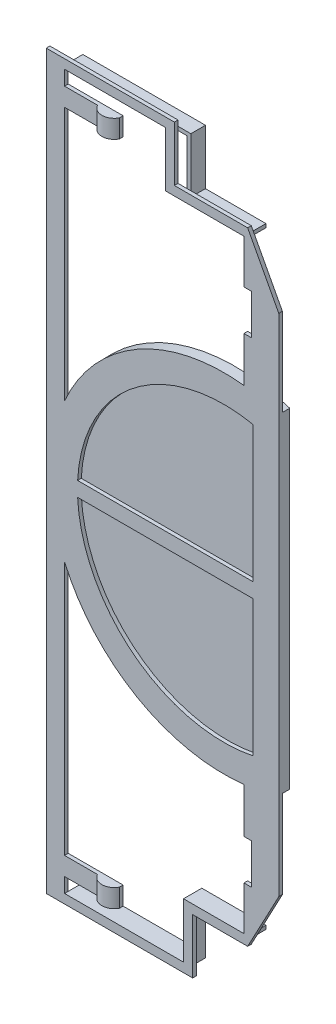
from build123d import *

# Parameters (mm, degrees)
PLAQUE_DEPTH          = 1
CERCLE_FILTRE_DEPTH   = 3
MUR_DE_CENTRAGE_DEPTH = 4
FILTRE_DEPTH          = 1
ESQUISSE10_W          = 2
ESQUISSE10_H          = 11
CLIPS_ARRI_RE_DEPTH   = 1.5
CLIP_DESSUS_DEPTH     = 2.5


with BuildPart() as part:
    # Esquisse1 → Plaque (new body)
    with BuildSketch(Plane.XY):
        Polygon((56.705873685, 85), (36.685288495, 85), (36.685288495, 100), (1.685288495, 100), (1.685288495, -100), (41.685288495, -100), (41.685288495, -85), (56.705873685, -85), (65.205873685, -69), (65.205873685, 69), align=None)
        Polygon((55.705873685, 45), (58.205873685, 45), (58.205873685, -45), (55.705873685, -45), (55.705873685, -82.5), (39.183229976, -82.5), (39.183229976, -97.5), (6.685288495, -97.5), (6.685288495, 97.5), (34.325394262, 97.5), (34.325394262, 82.5), (55.705873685, 82.5), align=None, mode=Mode.SUBTRACT)
    extrude(amount=PLAQUE_DEPTH)

    # Esquisse2 → Cercle filtre (add)
    with BuildSketch(Plane.XY.offset(1)):
        with BuildLine():
            Line((65.205873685, -45.069390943), (65.205873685, 45.069390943))
            ThreePointArc((65.205873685, 45.069390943), (2.705873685, 0), (65.205873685, -45.069390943))
        make_face()
        with BuildLine():
            Line((58.205873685, -39.191835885), (58.205873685, -2))
            Line((58.205873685, -2), (10.255904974, -2))
            ThreePointArc((10.255904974, -2), (25.690403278, -31.606830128), (58.205873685, -39.191835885))
        make_face(mode=Mode.SUBTRACT)
        with BuildLine():
            Line((10.255904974, 2), (58.205873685, 2))
            Line((58.205873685, 2), (58.205873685, 39.191835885))
            ThreePointArc((58.205873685, 39.191835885), (25.690403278, 31.606830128), (10.255904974, 2))
        make_face(mode=Mode.SUBTRACT)
    extrude(amount=-CERCLE_FILTRE_DEPTH)

    # Esquisse7 → Mur de centrage (add)
    with BuildSketch(Plane(origin=(0, 0, 0), x_dir=(-1, 0, 0), z_dir=(0, 0, -1))):
        Polygon((-56.705873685, 82.5), (-55.705873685, 82.5), (-39.183229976, 82.5), (-39.183229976, 97.5), (-6.685288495, 97.5), (-6.685288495, 98.5), (-40.183229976, 98.5), (-40.183229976, 83.5), (-55.705873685, 83.5), (-56.705873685, 83.5), align=None)
    mur_de_centrage = extrude(amount=MUR_DE_CENTRAGE_DEPTH)

    # Sym_trie1: Mur de centrage across plane
    add(mur_de_centrage.mirror(Plane.ZX))

    # Esquisse8 → Filtre (add)
    with BuildSketch(Plane(origin=(0, 0, 0), x_dir=(-1, 0, 0), z_dir=(0, 0, -1))):
        with BuildLine():
            Line((-58.205873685, -2), (-10.255904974, -2))
            ThreePointArc((-10.255904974, -2), (-25.690403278, -31.606830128), (-58.205873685, -39.191835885))
            Line((-58.205873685, -39.191835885), (-58.205873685, -2))
        make_face()
        with BuildLine():
            Line((-10.255904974, 2), (-58.205873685, 2))
            Line((-58.205873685, 2), (-58.205873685, 39.191835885))
            ThreePointArc((-58.205873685, 39.191835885), (-25.690403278, 31.606830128), (-10.255904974, 2))
        make_face()
    extrude(amount=FILTRE_DEPTH)

    # Esquisse10 → Clips arri_re (cut)
    with BuildSketch(Plane.XY.offset(1)):
        with Locations((56.705873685, 65)):
            Rectangle(ESQUISSE10_W, ESQUISSE10_H)
        with Locations((56.705873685, -65)):
            Rectangle(ESQUISSE10_W, ESQUISSE10_H)
    extrude(amount=-CLIPS_ARRI_RE_DEPTH, mode=Mode.SUBTRACT)

    # Esquisse13 → Clip dessus (add, symmetric)
    with BuildSketch(Plane(origin=(0, 91, 0), x_dir=(-1, 0, 0), z_dir=(0, 1, 0))):
        with BuildLine():
            Line((-6.685288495, 1), (-15.685288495, 1))
            ThreePointArc((-15.685288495, 1), (-18.685288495, 2.8), (-21.685288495, 1))
            Line((-21.685288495, 1), (-21.685288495, 0))
            Line((-21.685288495, 0), (-6.685288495, 0))
            Line((-6.685288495, 0), (-6.685288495, 1))
        make_face()
    clip_dessus = extrude(amount=CLIP_DESSUS_DEPTH, both=True)

    # Sym_trie3: Clip dessus across plane
    add(clip_dessus.mirror(Plane.ZX))


solid = part.part
